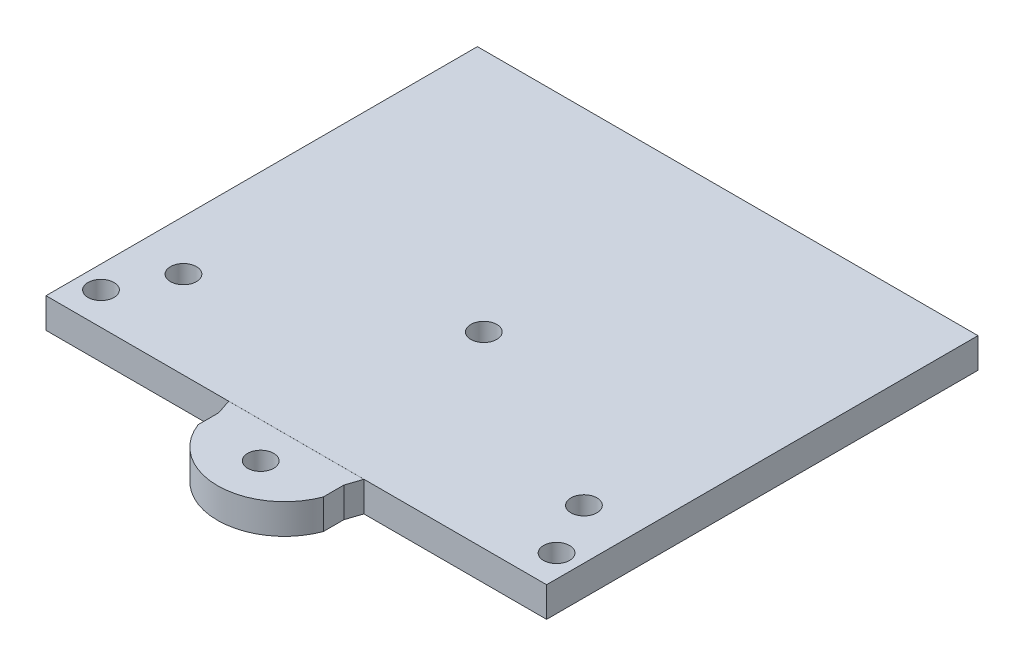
ISO-10303-21;
HEADER;
FILE_DESCRIPTION(('STEP AP214'),'2;1');
FILE_NAME('part.step','',(''),(''),'','','');
FILE_SCHEMA(('AUTOMOTIVE_DESIGN { 1 0 10303 214 1 1 1 1 }'));
ENDSEC;
DATA;
#1=APPLICATION_CONTEXT('core data for automotive mechanical design processes');
#2=APPLICATION_PROTOCOL_DEFINITION('international standard','automotive_design',2000,#1);
#3=PRODUCT_CONTEXT('',#1,'mechanical');
#4=PRODUCT('Part','Part','',(#3));
#5=PRODUCT_RELATED_PRODUCT_CATEGORY('part','',(#4));
#6=PRODUCT_DEFINITION_FORMATION('','',#4);
#7=PRODUCT_DEFINITION_CONTEXT('part definition',#1,'design');
#8=PRODUCT_DEFINITION('design','',#6,#7);
#9=PRODUCT_DEFINITION_SHAPE('','',#8);
#10=(LENGTH_UNIT() NAMED_UNIT(*) SI_UNIT(.MILLI.,.METRE.));
#11=(NAMED_UNIT(*) PLANE_ANGLE_UNIT() SI_UNIT($,.RADIAN.));
#12=(NAMED_UNIT(*) SI_UNIT($,.STERADIAN.) SOLID_ANGLE_UNIT());
#13=UNCERTAINTY_MEASURE_WITH_UNIT(LENGTH_MEASURE(1.E-05),#10,'distance_accuracy_value','');
#14=(GEOMETRIC_REPRESENTATION_CONTEXT(3) GLOBAL_UNCERTAINTY_ASSIGNED_CONTEXT((#13)) GLOBAL_UNIT_ASSIGNED_CONTEXT((#10,
#11,#12)) REPRESENTATION_CONTEXT('',''));
#15=CARTESIAN_POINT('',(0.,0.,0.));
#16=DIRECTION('',(0.,0.,1.));
#17=DIRECTION('',(1.,0.,0.));
#18=AXIS2_PLACEMENT_3D('',#15,#16,#17);
#19=CARTESIAN_POINT('',(-50000.,-6000.,172520.004272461));
#20=DIRECTION('',(-1.,0.,0.));
#21=DIRECTION('',(0.,0.,1.));
#22=AXIS2_PLACEMENT_3D('',#19,#20,#21);
#23=PLANE('',#22);
#24=DIRECTION('',(0.,1.,0.));
#25=VECTOR('',#24,1.);
#26=CARTESIAN_POINT('',(-50000.,-10000.,199800.003051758));
#27=LINE('',#26,#25);
#28=CARTESIAN_POINT('',(-50000.,-6000.,199800.003051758));
#29=VERTEX_POINT('',#28);
#30=CARTESIAN_POINT('',(-50000.,0.,199800.003051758));
#31=VERTEX_POINT('',#30);
#32=EDGE_CURVE('E51',#29,#31,#27,.T.);
#33=ORIENTED_EDGE('',*,*,#32,.F.);
#34=DIRECTION('',(0.,0.,1.));
#35=VECTOR('',#34,1.);
#36=CARTESIAN_POINT('',(-50000.,-6000.,172520.004272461));
#37=LINE('',#36,#35);
#38=CARTESIAN_POINT('',(-50000.,-6000.,285980.010986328));
#39=VERTEX_POINT('',#38);
#40=EDGE_CURVE('E138',#29,#39,#37,.T.);
#41=ORIENTED_EDGE('',*,*,#40,.T.);
#42=DIRECTION('',(0.,1.,0.));
#43=VECTOR('',#42,1.);
#44=CARTESIAN_POINT('',(-50000.,-6000.,285980.010986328));
#45=LINE('',#44,#43);
#46=CARTESIAN_POINT('',(-50000.,0.,285980.010986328));
#47=VERTEX_POINT('',#46);
#48=EDGE_CURVE('E43',#39,#47,#45,.T.);
#49=ORIENTED_EDGE('',*,*,#48,.T.);
#50=DIRECTION('',(0.,0.,1.));
#51=VECTOR('',#50,1.);
#52=CARTESIAN_POINT('',(-50000.,0.,172520.004272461));
#53=LINE('',#52,#51);
#54=EDGE_CURVE('E142',#31,#47,#53,.T.);
#55=ORIENTED_EDGE('',*,*,#54,.F.);
#56=EDGE_LOOP('',(#33,#41,#49,#55));
#57=FACE_BOUND('',#56,.T.);
#58=ADVANCED_FACE('F35',(#57),#23,.T.);
#59=CARTESIAN_POINT('',(50000.,-6000.,172520.004272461));
#60=DIRECTION('',(-1.,0.,0.));
#61=DIRECTION('',(0.,0.,1.));
#62=AXIS2_PLACEMENT_3D('',#59,#60,#61);
#63=PLANE('',#62);
#64=DIRECTION('',(0.,0.,1.));
#65=VECTOR('',#64,1.);
#66=CARTESIAN_POINT('',(50000.,-6000.,172520.004272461));
#67=LINE('',#66,#65);
#68=CARTESIAN_POINT('',(50000.0000000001,-6000.,199800.003051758));
#69=VERTEX_POINT('',#68);
#70=CARTESIAN_POINT('',(50000.,-6000.,285980.010986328));
#71=VERTEX_POINT('',#70);
#72=EDGE_CURVE('E130',#69,#71,#67,.T.);
#73=ORIENTED_EDGE('',*,*,#72,.F.);
#74=DIRECTION('',(0.,1.,0.));
#75=VECTOR('',#74,1.);
#76=CARTESIAN_POINT('',(50000.0000000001,-10000.,199800.003051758));
#77=LINE('',#76,#75);
#78=CARTESIAN_POINT('',(50000.0000000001,0.,199800.003051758));
#79=VERTEX_POINT('',#78);
#80=EDGE_CURVE('E119',#69,#79,#77,.T.);
#81=ORIENTED_EDGE('',*,*,#80,.T.);
#82=DIRECTION('',(0.,0.,1.));
#83=VECTOR('',#82,1.);
#84=CARTESIAN_POINT('',(50000.,0.,172520.004272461));
#85=LINE('',#84,#83);
#86=CARTESIAN_POINT('',(50000.,0.,285980.010986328));
#87=VERTEX_POINT('',#86);
#88=EDGE_CURVE('E129',#79,#87,#85,.T.);
#89=ORIENTED_EDGE('',*,*,#88,.T.);
#90=DIRECTION('',(0.,1.,0.));
#91=VECTOR('',#90,1.);
#92=CARTESIAN_POINT('',(50000.,-6000.,285980.010986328));
#93=LINE('',#92,#91);
#94=EDGE_CURVE('E11',#71,#87,#93,.T.);
#95=ORIENTED_EDGE('',*,*,#94,.F.);
#96=EDGE_LOOP('',(#73,#81,#89,#95));
#97=FACE_BOUND('',#96,.T.);
#98=ADVANCED_FACE('F127',(#97),#63,.F.);
#99=CARTESIAN_POINT('',(-50000.,-6000.,285980.010986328));
#100=DIRECTION('',(0.,0.,1.));
#101=DIRECTION('',(1.,0.,0.));
#102=AXIS2_PLACEMENT_3D('',#99,#100,#101);
#103=PLANE('',#102);
#104=DIRECTION('',(0.,-1.,0.));
#105=VECTOR('',#104,1.);
#106=CARTESIAN_POINT('',(-13500.,-9.99999999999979,285980.010986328));
#107=LINE('',#106,#105);
#108=CARTESIAN_POINT('',(-13500.,-9.99999999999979,285980.010986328));
#109=VERTEX_POINT('',#108);
#110=CARTESIAN_POINT('',(-13500.,-6000.,285980.010986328));
#111=VERTEX_POINT('',#110);
#112=EDGE_CURVE('E233',#109,#111,#107,.T.);
#113=ORIENTED_EDGE('',*,*,#112,.F.);
#114=DIRECTION('',(1.,0.,0.));
#115=VECTOR('',#114,1.);
#116=CARTESIAN_POINT('',(-13500.,-9.99999999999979,285980.010986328));
#117=LINE('',#116,#115);
#118=CARTESIAN_POINT('',(13500.,-9.99999999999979,285980.010986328));
#119=VERTEX_POINT('',#118);
#120=EDGE_CURVE('E195',#109,#119,#117,.T.);
#121=ORIENTED_EDGE('',*,*,#120,.T.);
#122=DIRECTION('',(0.,-1.,0.));
#123=VECTOR('',#122,1.);
#124=CARTESIAN_POINT('',(13500.,-9.99999999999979,285980.010986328));
#125=LINE('',#124,#123);
#126=CARTESIAN_POINT('',(13500.,-6000.,285980.010986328));
#127=VERTEX_POINT('',#126);
#128=EDGE_CURVE('E230',#119,#127,#125,.T.);
#129=ORIENTED_EDGE('',*,*,#128,.T.);
#130=DIRECTION('',(1.,0.,0.));
#131=VECTOR('',#130,1.);
#132=CARTESIAN_POINT('',(-50000.,-6000.,285980.010986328));
#133=LINE('',#132,#131);
#134=EDGE_CURVE('E140',#127,#71,#133,.T.);
#135=ORIENTED_EDGE('',*,*,#134,.T.);
#136=ORIENTED_EDGE('',*,*,#94,.T.);
#137=DIRECTION('',(1.,0.,0.));
#138=VECTOR('',#137,1.);
#139=CARTESIAN_POINT('',(-50000.,0.,285980.010986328));
#140=LINE('',#139,#138);
#141=EDGE_CURVE('E137',#47,#87,#140,.T.);
#142=ORIENTED_EDGE('',*,*,#141,.F.);
#143=ORIENTED_EDGE('',*,*,#48,.F.);
#144=EDGE_CURVE('E238',#39,#111,#133,.T.);
#145=ORIENTED_EDGE('',*,*,#144,.T.);
#146=EDGE_LOOP('',(#113,#121,#129,#135,#136,#142,#143,#145));
#147=FACE_BOUND('',#146,.T.);
#148=ADVANCED_FACE('F248',(#147),#103,.T.);
#149=CARTESIAN_POINT('',(0.,-6000.,0.));
#150=DIRECTION('',(0.,1.,0.));
#151=DIRECTION('',(0.,0.,1.));
#152=AXIS2_PLACEMENT_3D('',#149,#150,#151);
#153=PLANE('',#152);
#154=CARTESIAN_POINT('',(0.00627276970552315,-6000.,248519.996643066));
#155=DIRECTION('',(0.,1.,0.));
#156=DIRECTION('',(0.,0.,1.));
#157=AXIS2_PLACEMENT_3D('',#154,#155,#156);
#158=CIRCLE('',#157,2599.99992484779);
#159=CARTESIAN_POINT('',(0.00627276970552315,-6000.,251119.996567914));
#160=VERTEX_POINT('',#159);
#161=EDGE_CURVE('E162',#160,#160,#158,.T.);
#162=ORIENTED_EDGE('',*,*,#161,.T.);
#163=EDGE_LOOP('',(#162));
#164=FACE_BOUND('',#163,.T.);
#165=CARTESIAN_POINT('',(39999.9982036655,-6000.,268519.992852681));
#166=DIRECTION('',(0.,1.,0.));
#167=DIRECTION('',(0.,0.,1.));
#168=AXIS2_PLACEMENT_3D('',#165,#166,#167);
#169=CIRCLE('',#168,2600.0065226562);
#170=CARTESIAN_POINT('',(39999.9982036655,-6000.,271119.999375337));
#171=VERTEX_POINT('',#170);
#172=EDGE_CURVE('E159',#171,#171,#169,.T.);
#173=ORIENTED_EDGE('',*,*,#172,.T.);
#174=EDGE_LOOP('',(#173));
#175=FACE_BOUND('',#174,.T.);
#176=CARTESIAN_POINT('',(-40000.0031073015,-6000.,268520.004272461));
#177=DIRECTION('',(0.,1.,0.));
#178=DIRECTION('',(0.,0.,1.));
#179=AXIS2_PLACEMENT_3D('',#176,#177,#178);
#180=CIRCLE('',#179,2600.00505940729);
#181=CARTESIAN_POINT('',(-40000.0031073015,-6000.,271120.009331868));
#182=VERTEX_POINT('',#181);
#183=EDGE_CURVE('E156',#182,#182,#180,.T.);
#184=ORIENTED_EDGE('',*,*,#183,.T.);
#185=EDGE_LOOP('',(#184));
#186=FACE_BOUND('',#185,.T.);
#187=CARTESIAN_POINT('',(45499.9998629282,-6000.,279495.002562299));
#188=DIRECTION('',(0.,1.,0.));
#189=DIRECTION('',(0.,0.,1.));
#190=AXIS2_PLACEMENT_3D('',#187,#188,#189);
#191=CIRCLE('',#190,2599.99834286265);
#192=CARTESIAN_POINT('',(45499.9998629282,-6000.,282095.000905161));
#193=VERTEX_POINT('',#192);
#194=EDGE_CURVE('E152',#193,#193,#191,.T.);
#195=ORIENTED_EDGE('',*,*,#194,.T.);
#196=EDGE_LOOP('',(#195));
#197=FACE_BOUND('',#196,.T.);
#198=CARTESIAN_POINT('',(-45499.9956063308,-6000.,279495.003650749));
#199=DIRECTION('',(0.,1.,0.));
#200=DIRECTION('',(0.,0.,1.));
#201=AXIS2_PLACEMENT_3D('',#198,#199,#200);
#202=CIRCLE('',#201,2600.00024530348);
#203=CARTESIAN_POINT('',(-45499.9956063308,-6000.,282095.003896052));
#204=VERTEX_POINT('',#203);
#205=EDGE_CURVE('E151',#204,#204,#202,.T.);
#206=ORIENTED_EDGE('',*,*,#205,.T.);
#207=EDGE_LOOP('',(#206));
#208=FACE_BOUND('',#207,.T.);
#209=ORIENTED_EDGE('',*,*,#40,.F.);
#210=DIRECTION('',(1.,0.,0.));
#211=VECTOR('',#210,1.);
#212=CARTESIAN_POINT('',(0.,-6000.,199800.003051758));
#213=LINE('',#212,#211);
#214=EDGE_CURVE('E131',#29,#69,#213,.T.);
#215=ORIENTED_EDGE('',*,*,#214,.T.);
#216=ORIENTED_EDGE('',*,*,#72,.T.);
#217=ORIENTED_EDGE('',*,*,#134,.F.);
#218=EDGE_CURVE('E241',#111,#127,#133,.T.);
#219=ORIENTED_EDGE('',*,*,#218,.F.);
#220=ORIENTED_EDGE('',*,*,#144,.F.);
#221=EDGE_LOOP('',(#209,#215,#216,#217,#219,#220));
#222=FACE_BOUND('',#221,.T.);
#223=ADVANCED_FACE('F256',(#164,#175,#186,#197,#208,#222),#153,.F.);
#224=CARTESIAN_POINT('',(0.,0.,0.));
#225=DIRECTION('',(0.,1.,0.));
#226=DIRECTION('',(0.,0.,1.));
#227=AXIS2_PLACEMENT_3D('',#224,#225,#226);
#228=PLANE('',#227);
#229=DIRECTION('',(1.,0.,0.));
#230=VECTOR('',#229,1.);
#231=CARTESIAN_POINT('',(-50000.,0.,199800.003051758));
#232=LINE('',#231,#230);
#233=EDGE_CURVE('E116',#31,#79,#232,.T.);
#234=ORIENTED_EDGE('',*,*,#233,.F.);
#235=ORIENTED_EDGE('',*,*,#54,.T.);
#236=ORIENTED_EDGE('',*,*,#141,.T.);
#237=ORIENTED_EDGE('',*,*,#88,.F.);
#238=EDGE_LOOP('',(#234,#235,#236,#237));
#239=FACE_BOUND('',#238,.T.);
#240=CARTESIAN_POINT('',(0.00627276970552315,0.,248519.996643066));
#241=DIRECTION('',(0.,1.,0.));
#242=DIRECTION('',(0.,0.,1.));
#243=AXIS2_PLACEMENT_3D('',#240,#241,#242);
#244=CIRCLE('',#243,2599.99992484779);
#245=CARTESIAN_POINT('',(0.00627276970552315,0.,251119.996567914));
#246=VERTEX_POINT('',#245);
#247=EDGE_CURVE('E38',#246,#246,#244,.T.);
#248=ORIENTED_EDGE('',*,*,#247,.F.);
#249=EDGE_LOOP('',(#248));
#250=FACE_BOUND('',#249,.T.);
#251=CARTESIAN_POINT('',(39999.9982036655,0.,268519.992852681));
#252=DIRECTION('',(0.,1.,0.));
#253=DIRECTION('',(0.,0.,1.));
#254=AXIS2_PLACEMENT_3D('',#251,#252,#253);
#255=CIRCLE('',#254,2600.0065226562);
#256=CARTESIAN_POINT('',(39999.9982036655,0.,271119.999375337));
#257=VERTEX_POINT('',#256);
#258=EDGE_CURVE('E160',#257,#257,#255,.T.);
#259=ORIENTED_EDGE('',*,*,#258,.F.);
#260=EDGE_LOOP('',(#259));
#261=FACE_BOUND('',#260,.T.);
#262=CARTESIAN_POINT('',(-40000.0031073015,0.,268520.004272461));
#263=DIRECTION('',(0.,1.,0.));
#264=DIRECTION('',(0.,0.,1.));
#265=AXIS2_PLACEMENT_3D('',#262,#263,#264);
#266=CIRCLE('',#265,2600.00505940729);
#267=CARTESIAN_POINT('',(-40000.0031073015,0.,271120.009331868));
#268=VERTEX_POINT('',#267);
#269=EDGE_CURVE('E157',#268,#268,#266,.T.);
#270=ORIENTED_EDGE('',*,*,#269,.F.);
#271=EDGE_LOOP('',(#270));
#272=FACE_BOUND('',#271,.T.);
#273=CARTESIAN_POINT('',(45499.9998629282,0.,279495.002562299));
#274=DIRECTION('',(0.,1.,0.));
#275=DIRECTION('',(0.,0.,1.));
#276=AXIS2_PLACEMENT_3D('',#273,#274,#275);
#277=CIRCLE('',#276,2599.99834286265);
#278=CARTESIAN_POINT('',(45499.9998629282,0.,282095.000905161));
#279=VERTEX_POINT('',#278);
#280=EDGE_CURVE('E153',#279,#279,#277,.T.);
#281=ORIENTED_EDGE('',*,*,#280,.F.);
#282=EDGE_LOOP('',(#281));
#283=FACE_BOUND('',#282,.T.);
#284=CARTESIAN_POINT('',(-45499.9956063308,0.,279495.003650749));
#285=DIRECTION('',(0.,1.,0.));
#286=DIRECTION('',(0.,0.,1.));
#287=AXIS2_PLACEMENT_3D('',#284,#285,#286);
#288=CIRCLE('',#287,2600.00024530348);
#289=CARTESIAN_POINT('',(-45499.9956063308,0.,282095.003896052));
#290=VERTEX_POINT('',#289);
#291=EDGE_CURVE('E148',#290,#290,#288,.T.);
#292=ORIENTED_EDGE('',*,*,#291,.F.);
#293=EDGE_LOOP('',(#292));
#294=FACE_BOUND('',#293,.T.);
#295=ADVANCED_FACE('F134',(#239,#250,#261,#272,#283,#294),#228,.T.);
#296=CARTESIAN_POINT('',(-12500.,-9.99999999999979,288980.010986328));
#297=DIRECTION('',(-1.,0.,0.));
#298=DIRECTION('',(0.,0.,1.));
#299=AXIS2_PLACEMENT_3D('',#296,#297,#298);
#300=PLANE('',#299);
#301=DIRECTION('',(0.,0.,-1.));
#302=VECTOR('',#301,1.);
#303=CARTESIAN_POINT('',(-12500.,-6010.,288980.010986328));
#304=LINE('',#303,#302);
#305=CARTESIAN_POINT('',(-12500.,-6010.,293095.001220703));
#306=VERTEX_POINT('',#305);
#307=CARTESIAN_POINT('',(-12500.,-6010.,288980.010986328));
#308=VERTEX_POINT('',#307);
#309=EDGE_CURVE('E185',#306,#308,#304,.T.);
#310=ORIENTED_EDGE('',*,*,#309,.F.);
#311=DIRECTION('',(0.,-1.,0.));
#312=VECTOR('',#311,1.);
#313=CARTESIAN_POINT('',(-12500.,-9.99999999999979,293095.001220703));
#314=LINE('',#313,#312);
#315=CARTESIAN_POINT('',(-12500.,-9.99999999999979,293095.001220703));
#316=VERTEX_POINT('',#315);
#317=EDGE_CURVE('E224',#316,#306,#314,.T.);
#318=ORIENTED_EDGE('',*,*,#317,.F.);
#319=DIRECTION('',(0.,0.,-1.));
#320=VECTOR('',#319,1.);
#321=CARTESIAN_POINT('',(-12500.,-9.99999999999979,288980.010986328));
#322=LINE('',#321,#320);
#323=CARTESIAN_POINT('',(-12500.,-9.99999999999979,288980.010986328));
#324=VERTEX_POINT('',#323);
#325=EDGE_CURVE('E188',#316,#324,#322,.T.);
#326=ORIENTED_EDGE('',*,*,#325,.T.);
#327=DIRECTION('',(0.,-1.,0.));
#328=VECTOR('',#327,1.);
#329=CARTESIAN_POINT('',(-12500.,-9.99999999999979,288980.010986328));
#330=LINE('',#329,#328);
#331=EDGE_CURVE('E207',#324,#308,#330,.T.);
#332=ORIENTED_EDGE('',*,*,#331,.T.);
#333=EDGE_LOOP('',(#310,#318,#326,#332));
#334=FACE_BOUND('',#333,.T.);
#335=ADVANCED_FACE('F268',(#334),#300,.T.);
#336=CARTESIAN_POINT('',(0.,-9.99999999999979,288333.976947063));
#337=DIRECTION('',(0.,-1.,0.));
#338=DIRECTION('',(0.,0.,-1.));
#339=AXIS2_PLACEMENT_3D('',#336,#337,#338);
#340=CYLINDRICAL_SURFACE('',#339,13375.9991078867);
#341=CARTESIAN_POINT('',(0.,-6010.,288333.976947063));
#342=DIRECTION('',(0.,-1.,0.));
#343=DIRECTION('',(0.,0.,1.));
#344=AXIS2_PLACEMENT_3D('',#341,#342,#343);
#345=CIRCLE('',#344,13375.9991078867);
#346=CARTESIAN_POINT('',(12500.,-6010.,293095.001220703));
#347=VERTEX_POINT('',#346);
#348=EDGE_CURVE('E192',#347,#306,#345,.T.);
#349=ORIENTED_EDGE('',*,*,#348,.F.);
#350=DIRECTION('',(0.,-1.,0.));
#351=VECTOR('',#350,1.);
#352=CARTESIAN_POINT('',(12500.,-9.99999999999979,293095.001220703));
#353=LINE('',#352,#351);
#354=CARTESIAN_POINT('',(12500.,-9.99999999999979,293095.001220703));
#355=VERTEX_POINT('',#354);
#356=EDGE_CURVE('E226',#355,#347,#353,.T.);
#357=ORIENTED_EDGE('',*,*,#356,.F.);
#358=CARTESIAN_POINT('',(0.,-9.99999999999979,288333.976947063));
#359=DIRECTION('',(0.,-1.,0.));
#360=DIRECTION('',(0.,0.,1.));
#361=AXIS2_PLACEMENT_3D('',#358,#359,#360);
#362=CIRCLE('',#361,13375.9991078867);
#363=EDGE_CURVE('E204',#355,#316,#362,.T.);
#364=ORIENTED_EDGE('',*,*,#363,.T.);
#365=ORIENTED_EDGE('',*,*,#317,.T.);
#366=EDGE_LOOP('',(#349,#357,#364,#365));
#367=FACE_BOUND('',#366,.T.);
#368=ADVANCED_FACE('F271',(#367),#340,.T.);
#369=CARTESIAN_POINT('',(12500.,-9.99999999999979,288980.010986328));
#370=DIRECTION('',(1.,0.,0.));
#371=DIRECTION('',(0.,0.,-1.));
#372=AXIS2_PLACEMENT_3D('',#369,#370,#371);
#373=PLANE('',#372);
#374=DIRECTION('',(0.,0.,1.));
#375=VECTOR('',#374,1.);
#376=CARTESIAN_POINT('',(12500.,-6010.,288980.010986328));
#377=LINE('',#376,#375);
#378=CARTESIAN_POINT('',(12500.,-6010.,288980.010986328));
#379=VERTEX_POINT('',#378);
#380=EDGE_CURVE('E219',#379,#347,#377,.T.);
#381=ORIENTED_EDGE('',*,*,#380,.F.);
#382=DIRECTION('',(0.,-1.,0.));
#383=VECTOR('',#382,1.);
#384=CARTESIAN_POINT('',(12500.,-9.99999999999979,288980.010986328));
#385=LINE('',#384,#383);
#386=CARTESIAN_POINT('',(12500.,-9.99999999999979,288980.010986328));
#387=VERTEX_POINT('',#386);
#388=EDGE_CURVE('E228',#387,#379,#385,.T.);
#389=ORIENTED_EDGE('',*,*,#388,.F.);
#390=DIRECTION('',(0.,0.,1.));
#391=VECTOR('',#390,1.);
#392=CARTESIAN_POINT('',(12500.,-9.99999999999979,288980.010986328));
#393=LINE('',#392,#391);
#394=EDGE_CURVE('E201',#387,#355,#393,.T.);
#395=ORIENTED_EDGE('',*,*,#394,.T.);
#396=ORIENTED_EDGE('',*,*,#356,.T.);
#397=EDGE_LOOP('',(#381,#389,#395,#396));
#398=FACE_BOUND('',#397,.T.);
#399=ADVANCED_FACE('F276',(#398),#373,.T.);
#400=CARTESIAN_POINT('',(13500.,-9.99999999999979,285980.010986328));
#401=DIRECTION('',(0.948683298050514,0.,0.316227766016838));
#402=DIRECTION('',(0.316227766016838,0.,-0.948683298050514));
#403=AXIS2_PLACEMENT_3D('',#400,#401,#402);
#404=PLANE('',#403);
#405=DIRECTION('',(-0.316227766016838,0.,0.948683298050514));
#406=VECTOR('',#405,1.);
#407=CARTESIAN_POINT('',(13500.,-6010.,285980.010986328));
#408=LINE('',#407,#406);
#409=CARTESIAN_POINT('',(13500.,-6010.,285980.010986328));
#410=VERTEX_POINT('',#409);
#411=EDGE_CURVE('E216',#410,#379,#408,.T.);
#412=ORIENTED_EDGE('',*,*,#411,.F.);
#413=EDGE_CURVE('E59',#127,#410,#125,.T.);
#414=ORIENTED_EDGE('',*,*,#413,.F.);
#415=ORIENTED_EDGE('',*,*,#128,.F.);
#416=DIRECTION('',(-0.316227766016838,0.,0.948683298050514));
#417=VECTOR('',#416,1.);
#418=CARTESIAN_POINT('',(13500.,-9.99999999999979,285980.010986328));
#419=LINE('',#418,#417);
#420=EDGE_CURVE('E198',#119,#387,#419,.T.);
#421=ORIENTED_EDGE('',*,*,#420,.T.);
#422=ORIENTED_EDGE('',*,*,#388,.T.);
#423=EDGE_LOOP('',(#412,#414,#415,#421,#422));
#424=FACE_BOUND('',#423,.T.);
#425=ADVANCED_FACE('F274',(#424),#404,.T.);
#426=CARTESIAN_POINT('',(-13500.,-9.99999999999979,285980.010986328));
#427=DIRECTION('',(0.,0.,-1.));
#428=DIRECTION('',(-1.,0.,0.));
#429=AXIS2_PLACEMENT_3D('',#426,#427,#428);
#430=PLANE('',#429);
#431=CARTESIAN_POINT('',(-13500.,-6010.,285980.010986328));
#432=VERTEX_POINT('',#431);
#433=EDGE_CURVE('E236',#111,#432,#107,.T.);
#434=ORIENTED_EDGE('',*,*,#433,.F.);
#435=ORIENTED_EDGE('',*,*,#218,.T.);
#436=ORIENTED_EDGE('',*,*,#413,.T.);
#437=DIRECTION('',(1.,0.,0.));
#438=VECTOR('',#437,1.);
#439=CARTESIAN_POINT('',(-13500.,-6010.,285980.010986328));
#440=LINE('',#439,#438);
#441=EDGE_CURVE('E213',#432,#410,#440,.T.);
#442=ORIENTED_EDGE('',*,*,#441,.F.);
#443=EDGE_LOOP('',(#434,#435,#436,#442));
#444=FACE_BOUND('',#443,.T.);
#445=ADVANCED_FACE('F254',(#444),#430,.T.);
#446=CARTESIAN_POINT('',(-12500.,-9.99999999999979,288980.010986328));
#447=DIRECTION('',(-0.948683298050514,0.,0.316227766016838));
#448=DIRECTION('',(0.316227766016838,0.,0.948683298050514));
#449=AXIS2_PLACEMENT_3D('',#446,#447,#448);
#450=PLANE('',#449);
#451=DIRECTION('',(-0.316227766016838,0.,-0.948683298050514));
#452=VECTOR('',#451,1.);
#453=CARTESIAN_POINT('',(-12500.,-6010.,288980.010986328));
#454=LINE('',#453,#452);
#455=EDGE_CURVE('E210',#308,#432,#454,.T.);
#456=ORIENTED_EDGE('',*,*,#455,.F.);
#457=ORIENTED_EDGE('',*,*,#331,.F.);
#458=DIRECTION('',(-0.316227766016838,0.,-0.948683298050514));
#459=VECTOR('',#458,1.);
#460=CARTESIAN_POINT('',(-12500.,-9.99999999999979,288980.010986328));
#461=LINE('',#460,#459);
#462=EDGE_CURVE('E191',#324,#109,#461,.T.);
#463=ORIENTED_EDGE('',*,*,#462,.T.);
#464=ORIENTED_EDGE('',*,*,#112,.T.);
#465=ORIENTED_EDGE('',*,*,#433,.T.);
#466=EDGE_LOOP('',(#456,#457,#463,#464,#465));
#467=FACE_BOUND('',#466,.T.);
#468=ADVANCED_FACE('F259',(#467),#450,.T.);
#469=CARTESIAN_POINT('',(0.,-9.99999999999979,288333.976947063));
#470=DIRECTION('',(0.,1.,0.));
#471=DIRECTION('',(0.,0.,1.));
#472=AXIS2_PLACEMENT_3D('',#469,#470,#471);
#473=PLANE('',#472);
#474=CARTESIAN_POINT('',(-0.00223523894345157,-9.99999999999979,293094.995074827));
#475=DIRECTION('',(0.,-1.,0.));
#476=DIRECTION('',(0.,0.,-1.));
#477=AXIS2_PLACEMENT_3D('',#474,#475,#476);
#478=CIRCLE('',#477,2600.0018299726);
#479=CARTESIAN_POINT('',(-0.00223523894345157,-9.99999999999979,290494.993244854));
#480=VERTEX_POINT('',#479);
#481=EDGE_CURVE('E182',#480,#480,#478,.T.);
#482=ORIENTED_EDGE('',*,*,#481,.T.);
#483=EDGE_LOOP('',(#482));
#484=FACE_BOUND('',#483,.T.);
#485=ORIENTED_EDGE('',*,*,#325,.F.);
#486=ORIENTED_EDGE('',*,*,#363,.F.);
#487=ORIENTED_EDGE('',*,*,#394,.F.);
#488=ORIENTED_EDGE('',*,*,#420,.F.);
#489=ORIENTED_EDGE('',*,*,#120,.F.);
#490=ORIENTED_EDGE('',*,*,#462,.F.);
#491=EDGE_LOOP('',(#485,#486,#487,#488,#489,#490));
#492=FACE_BOUND('',#491,.T.);
#493=ADVANCED_FACE('F263',(#484,#492),#473,.T.);
#494=CARTESIAN_POINT('',(0.,-6010.,288333.976947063));
#495=DIRECTION('',(0.,1.,0.));
#496=DIRECTION('',(0.,0.,1.));
#497=AXIS2_PLACEMENT_3D('',#494,#495,#496);
#498=PLANE('',#497);
#499=CARTESIAN_POINT('',(-0.00223523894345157,-6010.,293094.995074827));
#500=DIRECTION('',(0.,-1.,0.));
#501=DIRECTION('',(0.,0.,-1.));
#502=AXIS2_PLACEMENT_3D('',#499,#500,#501);
#503=CIRCLE('',#502,2600.0018299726);
#504=CARTESIAN_POINT('',(-0.00223523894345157,-6010.,290494.993244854));
#505=VERTEX_POINT('',#504);
#506=EDGE_CURVE('E181',#505,#505,#503,.T.);
#507=ORIENTED_EDGE('',*,*,#506,.F.);
#508=EDGE_LOOP('',(#507));
#509=FACE_BOUND('',#508,.T.);
#510=ORIENTED_EDGE('',*,*,#309,.T.);
#511=ORIENTED_EDGE('',*,*,#455,.T.);
#512=ORIENTED_EDGE('',*,*,#441,.T.);
#513=ORIENTED_EDGE('',*,*,#411,.T.);
#514=ORIENTED_EDGE('',*,*,#380,.T.);
#515=ORIENTED_EDGE('',*,*,#348,.T.);
#516=EDGE_LOOP('',(#510,#511,#512,#513,#514,#515));
#517=FACE_BOUND('',#516,.T.);
#518=ADVANCED_FACE('F278',(#509,#517),#498,.F.);
#519=CARTESIAN_POINT('',(-0.00223523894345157,-9.99999999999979,293094.995074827));
#520=DIRECTION('',(0.,-1.,0.));
#521=DIRECTION('',(0.,0.,-1.));
#522=AXIS2_PLACEMENT_3D('',#519,#520,#521);
#523=CYLINDRICAL_SURFACE('',#522,2600.0018299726);
#524=ORIENTED_EDGE('',*,*,#481,.F.);
#525=EDGE_LOOP('',(#524));
#526=FACE_BOUND('',#525,.T.);
#527=ORIENTED_EDGE('',*,*,#506,.T.);
#528=EDGE_LOOP('',(#527));
#529=FACE_BOUND('',#528,.T.);
#530=ADVANCED_FACE('F280',(#526,#529),#523,.F.);
#531=CARTESIAN_POINT('',(-45499.9956063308,490.,279495.003650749));
#532=DIRECTION('',(0.,-1.,0.));
#533=DIRECTION('',(0.,0.,-1.));
#534=AXIS2_PLACEMENT_3D('',#531,#532,#533);
#535=CYLINDRICAL_SURFACE('',#534,2600.00024530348);
#536=ORIENTED_EDGE('',*,*,#291,.T.);
#537=EDGE_LOOP('',(#536));
#538=FACE_BOUND('',#537,.T.);
#539=ORIENTED_EDGE('',*,*,#205,.F.);
#540=EDGE_LOOP('',(#539));
#541=FACE_BOUND('',#540,.T.);
#542=ADVANCED_FACE('F287',(#538,#541),#535,.F.);
#543=CARTESIAN_POINT('',(45499.9998629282,490.,279495.002562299));
#544=DIRECTION('',(0.,-1.,0.));
#545=DIRECTION('',(0.,0.,-1.));
#546=AXIS2_PLACEMENT_3D('',#543,#544,#545);
#547=CYLINDRICAL_SURFACE('',#546,2599.99834286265);
#548=ORIENTED_EDGE('',*,*,#280,.T.);
#549=EDGE_LOOP('',(#548));
#550=FACE_BOUND('',#549,.T.);
#551=ORIENTED_EDGE('',*,*,#194,.F.);
#552=EDGE_LOOP('',(#551));
#553=FACE_BOUND('',#552,.T.);
#554=ADVANCED_FACE('F360',(#550,#553),#547,.F.);
#555=CARTESIAN_POINT('',(-40000.0031073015,490.,268520.004272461));
#556=DIRECTION('',(0.,-1.,0.));
#557=DIRECTION('',(0.,0.,-1.));
#558=AXIS2_PLACEMENT_3D('',#555,#556,#557);
#559=CYLINDRICAL_SURFACE('',#558,2600.00505940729);
#560=ORIENTED_EDGE('',*,*,#269,.T.);
#561=EDGE_LOOP('',(#560));
#562=FACE_BOUND('',#561,.T.);
#563=ORIENTED_EDGE('',*,*,#183,.F.);
#564=EDGE_LOOP('',(#563));
#565=FACE_BOUND('',#564,.T.);
#566=ADVANCED_FACE('F370',(#562,#565),#559,.F.);
#567=CARTESIAN_POINT('',(39999.9982036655,490.,268519.992852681));
#568=DIRECTION('',(0.,-1.,0.));
#569=DIRECTION('',(0.,0.,-1.));
#570=AXIS2_PLACEMENT_3D('',#567,#568,#569);
#571=CYLINDRICAL_SURFACE('',#570,2600.0065226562);
#572=ORIENTED_EDGE('',*,*,#258,.T.);
#573=EDGE_LOOP('',(#572));
#574=FACE_BOUND('',#573,.T.);
#575=ORIENTED_EDGE('',*,*,#172,.F.);
#576=EDGE_LOOP('',(#575));
#577=FACE_BOUND('',#576,.T.);
#578=ADVANCED_FACE('F380',(#574,#577),#571,.F.);
#579=CARTESIAN_POINT('',(0.00627276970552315,490.,248519.996643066));
#580=DIRECTION('',(0.,-1.,0.));
#581=DIRECTION('',(0.,0.,-1.));
#582=AXIS2_PLACEMENT_3D('',#579,#580,#581);
#583=CYLINDRICAL_SURFACE('',#582,2599.99992484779);
#584=ORIENTED_EDGE('',*,*,#247,.T.);
#585=EDGE_LOOP('',(#584));
#586=FACE_BOUND('',#585,.T.);
#587=ORIENTED_EDGE('',*,*,#161,.F.);
#588=EDGE_LOOP('',(#587));
#589=FACE_BOUND('',#588,.T.);
#590=ADVANCED_FACE('F390',(#586,#589),#583,.F.);
#591=CARTESIAN_POINT('',(-50000.,-10000.,199800.003051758));
#592=DIRECTION('',(0.,0.,1.));
#593=DIRECTION('',(1.,0.,0.));
#594=AXIS2_PLACEMENT_3D('',#591,#592,#593);
#595=PLANE('',#594);
#596=ORIENTED_EDGE('',*,*,#32,.T.);
#597=ORIENTED_EDGE('',*,*,#233,.T.);
#598=ORIENTED_EDGE('',*,*,#80,.F.);
#599=ORIENTED_EDGE('',*,*,#214,.F.);
#600=EDGE_LOOP('',(#596,#597,#598,#599));
#601=FACE_BOUND('',#600,.T.);
#602=ADVANCED_FACE('F118',(#601),#595,.F.);
#603=CLOSED_SHELL('',(#58,#98,#148,#223,#295,#335,#368,#399,#425,#445,#468,#493,#518,#530,#542,
#554,#566,#578,#590,#602));
#604=MANIFOLD_SOLID_BREP('B2',#603);
#605=ADVANCED_BREP_SHAPE_REPRESENTATION('',(#18,#604),#14);
#606=SHAPE_DEFINITION_REPRESENTATION(#9,#605);
ENDSEC;
END-ISO-10303-21;
